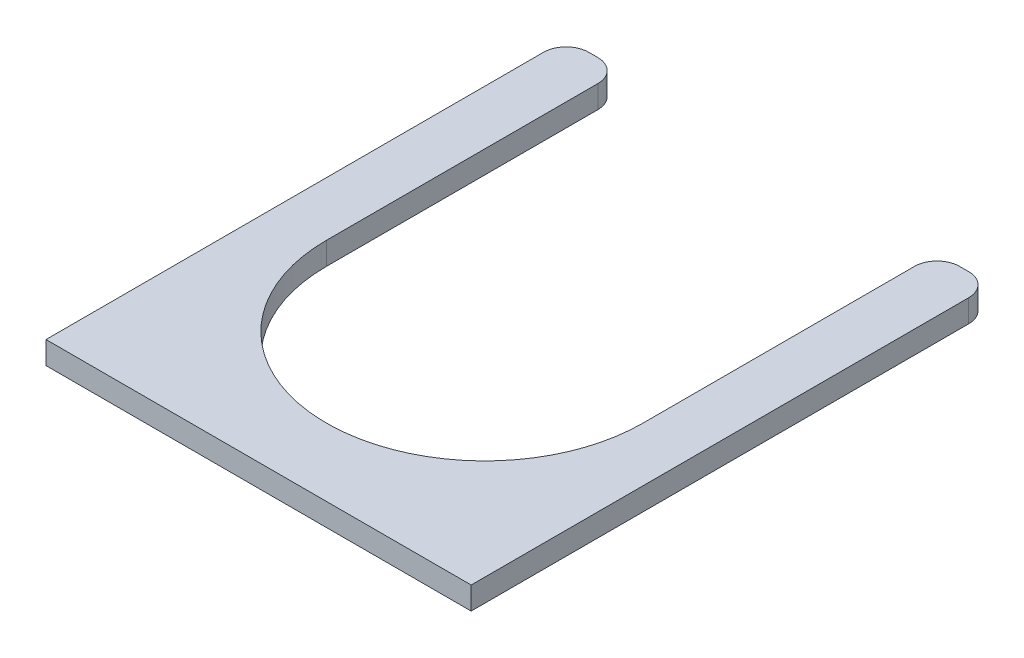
ISO-10303-21;
HEADER;
FILE_DESCRIPTION(('STEP AP214'),'2;1');
FILE_NAME('part.step','',(''),(''),'','','');
FILE_SCHEMA(('AUTOMOTIVE_DESIGN { 1 0 10303 214 1 1 1 1 }'));
ENDSEC;
DATA;
#1=APPLICATION_CONTEXT('core data for automotive mechanical design processes');
#2=APPLICATION_PROTOCOL_DEFINITION('international standard','automotive_design',2000,#1);
#3=PRODUCT_CONTEXT('',#1,'mechanical');
#4=PRODUCT('Part','Part','',(#3));
#5=PRODUCT_RELATED_PRODUCT_CATEGORY('part','',(#4));
#6=PRODUCT_DEFINITION_FORMATION('','',#4);
#7=PRODUCT_DEFINITION_CONTEXT('part definition',#1,'design');
#8=PRODUCT_DEFINITION('design','',#6,#7);
#9=PRODUCT_DEFINITION_SHAPE('','',#8);
#10=(LENGTH_UNIT() NAMED_UNIT(*) SI_UNIT(.MILLI.,.METRE.));
#11=(NAMED_UNIT(*) PLANE_ANGLE_UNIT() SI_UNIT($,.RADIAN.));
#12=(NAMED_UNIT(*) SI_UNIT($,.STERADIAN.) SOLID_ANGLE_UNIT());
#13=UNCERTAINTY_MEASURE_WITH_UNIT(LENGTH_MEASURE(1.E-05),#10,'distance_accuracy_value','');
#14=(GEOMETRIC_REPRESENTATION_CONTEXT(3) GLOBAL_UNCERTAINTY_ASSIGNED_CONTEXT((#13)) GLOBAL_UNIT_ASSIGNED_CONTEXT((#10,
#11,#12)) REPRESENTATION_CONTEXT('',''));
#15=CARTESIAN_POINT('',(0.,0.,0.));
#16=DIRECTION('',(0.,0.,1.));
#17=DIRECTION('',(1.,0.,0.));
#18=AXIS2_PLACEMENT_3D('',#15,#16,#17);
#19=CARTESIAN_POINT('',(47.,-5.,-52.5));
#20=DIRECTION('',(1.,0.,0.));
#21=DIRECTION('',(0.,0.,-1.));
#22=AXIS2_PLACEMENT_3D('',#19,#20,#21);
#23=PLANE('',#22);
#24=DIRECTION('',(0.,0.,-1.));
#25=VECTOR('',#24,1.);
#26=CARTESIAN_POINT('',(47.,0.,-52.5));
#27=LINE('',#26,#25);
#28=CARTESIAN_POINT('',(47.,0.,57.5));
#29=VERTEX_POINT('',#28);
#30=CARTESIAN_POINT('',(47.,0.,-52.5));
#31=VERTEX_POINT('',#30);
#32=EDGE_CURVE('E155',#29,#31,#27,.T.);
#33=ORIENTED_EDGE('',*,*,#32,.F.);
#34=DIRECTION('',(0.,1.,0.));
#35=VECTOR('',#34,1.);
#36=CARTESIAN_POINT('',(47.,-5.,57.5));
#37=LINE('',#36,#35);
#38=CARTESIAN_POINT('',(47.,-5.,57.5));
#39=VERTEX_POINT('',#38);
#40=EDGE_CURVE('E11',#39,#29,#37,.T.);
#41=ORIENTED_EDGE('',*,*,#40,.F.);
#42=DIRECTION('',(0.,0.,-1.));
#43=VECTOR('',#42,1.);
#44=CARTESIAN_POINT('',(47.,-5.,-52.5));
#45=LINE('',#44,#43);
#46=CARTESIAN_POINT('',(47.,-5.,-52.5));
#47=VERTEX_POINT('',#46);
#48=EDGE_CURVE('E187',#39,#47,#45,.T.);
#49=ORIENTED_EDGE('',*,*,#48,.T.);
#50=DIRECTION('',(0.,1.,0.));
#51=VECTOR('',#50,1.);
#52=CARTESIAN_POINT('',(47.,-5.,-52.5));
#53=LINE('',#52,#51);
#54=EDGE_CURVE('E37',#47,#31,#53,.T.);
#55=ORIENTED_EDGE('',*,*,#54,.T.);
#56=EDGE_LOOP('',(#33,#41,#49,#55));
#57=FACE_BOUND('',#56,.T.);
#58=ADVANCED_FACE('F34',(#57),#23,.T.);
#59=CARTESIAN_POINT('',(-47.,-5.,57.5));
#60=DIRECTION('',(0.,0.,1.));
#61=DIRECTION('',(1.,0.,0.));
#62=AXIS2_PLACEMENT_3D('',#59,#60,#61);
#63=PLANE('',#62);
#64=DIRECTION('',(1.,0.,0.));
#65=VECTOR('',#64,1.);
#66=CARTESIAN_POINT('',(-47.,0.,57.5));
#67=LINE('',#66,#65);
#68=CARTESIAN_POINT('',(-47.,0.,57.5));
#69=VERTEX_POINT('',#68);
#70=EDGE_CURVE('E185',#69,#29,#67,.T.);
#71=ORIENTED_EDGE('',*,*,#70,.F.);
#72=DIRECTION('',(0.,1.,0.));
#73=VECTOR('',#72,1.);
#74=CARTESIAN_POINT('',(-47.,-5.,57.5));
#75=LINE('',#74,#73);
#76=CARTESIAN_POINT('',(-47.,-5.,57.5));
#77=VERTEX_POINT('',#76);
#78=EDGE_CURVE('E43',#77,#69,#75,.T.);
#79=ORIENTED_EDGE('',*,*,#78,.F.);
#80=DIRECTION('',(1.,0.,0.));
#81=VECTOR('',#80,1.);
#82=CARTESIAN_POINT('',(-47.,-5.,57.5));
#83=LINE('',#82,#81);
#84=EDGE_CURVE('E145',#77,#39,#83,.T.);
#85=ORIENTED_EDGE('',*,*,#84,.T.);
#86=ORIENTED_EDGE('',*,*,#40,.T.);
#87=EDGE_LOOP('',(#71,#79,#85,#86));
#88=FACE_BOUND('',#87,.T.);
#89=ADVANCED_FACE('F207',(#88),#63,.T.);
#90=CARTESIAN_POINT('',(-47.,-5.,-52.5));
#91=DIRECTION('',(-1.,0.,0.));
#92=DIRECTION('',(0.,0.,1.));
#93=AXIS2_PLACEMENT_3D('',#90,#91,#92);
#94=PLANE('',#93);
#95=DIRECTION('',(0.,0.,1.));
#96=VECTOR('',#95,1.);
#97=CARTESIAN_POINT('',(-47.,0.,-52.5));
#98=LINE('',#97,#96);
#99=CARTESIAN_POINT('',(-47.,0.,-52.5));
#100=VERTEX_POINT('',#99);
#101=EDGE_CURVE('E132',#100,#69,#98,.T.);
#102=ORIENTED_EDGE('',*,*,#101,.F.);
#103=DIRECTION('',(0.,1.,0.));
#104=VECTOR('',#103,1.);
#105=CARTESIAN_POINT('',(-47.,-5.,-52.5));
#106=LINE('',#105,#104);
#107=CARTESIAN_POINT('',(-47.,-5.,-52.5));
#108=VERTEX_POINT('',#107);
#109=EDGE_CURVE('E127',#108,#100,#106,.T.);
#110=ORIENTED_EDGE('',*,*,#109,.F.);
#111=DIRECTION('',(0.,0.,1.));
#112=VECTOR('',#111,1.);
#113=CARTESIAN_POINT('',(-47.,-5.,-52.5));
#114=LINE('',#113,#112);
#115=EDGE_CURVE('E130',#108,#77,#114,.T.);
#116=ORIENTED_EDGE('',*,*,#115,.T.);
#117=ORIENTED_EDGE('',*,*,#78,.T.);
#118=EDGE_LOOP('',(#102,#110,#116,#117));
#119=FACE_BOUND('',#118,.T.);
#120=ADVANCED_FACE('F129',(#119),#94,.T.);
#121=CARTESIAN_POINT('',(-42.,-5.,-52.5));
#122=DIRECTION('',(0.,1.,0.));
#123=DIRECTION('',(0.,0.,1.));
#124=AXIS2_PLACEMENT_3D('',#121,#122,#123);
#125=CYLINDRICAL_SURFACE('',#124,5.);
#126=CARTESIAN_POINT('',(-42.,0.,-52.5));
#127=DIRECTION('',(0.,1.,0.));
#128=DIRECTION('',(0.,0.,1.));
#129=AXIS2_PLACEMENT_3D('',#126,#127,#128);
#130=CIRCLE('',#129,5.);
#131=CARTESIAN_POINT('',(-42.,0.,-57.5));
#132=VERTEX_POINT('',#131);
#133=EDGE_CURVE('E182',#132,#100,#130,.T.);
#134=ORIENTED_EDGE('',*,*,#133,.F.);
#135=DIRECTION('',(0.,1.,0.));
#136=VECTOR('',#135,1.);
#137=CARTESIAN_POINT('',(-42.,-5.,-57.5));
#138=LINE('',#137,#136);
#139=CARTESIAN_POINT('',(-42.,-5.,-57.5));
#140=VERTEX_POINT('',#139);
#141=EDGE_CURVE('E137',#140,#132,#138,.T.);
#142=ORIENTED_EDGE('',*,*,#141,.F.);
#143=CARTESIAN_POINT('',(-42.,-5.,-52.5));
#144=DIRECTION('',(0.,1.,0.));
#145=DIRECTION('',(0.,0.,1.));
#146=AXIS2_PLACEMENT_3D('',#143,#144,#145);
#147=CIRCLE('',#146,5.);
#148=EDGE_CURVE('E143',#140,#108,#147,.T.);
#149=ORIENTED_EDGE('',*,*,#148,.T.);
#150=ORIENTED_EDGE('',*,*,#109,.T.);
#151=EDGE_LOOP('',(#134,#142,#149,#150));
#152=FACE_BOUND('',#151,.T.);
#153=ADVANCED_FACE('F147',(#152),#125,.T.);
#154=CARTESIAN_POINT('',(-42.,-5.,-57.5));
#155=DIRECTION('',(0.,0.,-1.));
#156=DIRECTION('',(-1.,0.,0.));
#157=AXIS2_PLACEMENT_3D('',#154,#155,#156);
#158=PLANE('',#157);
#159=DIRECTION('',(-1.,0.,0.));
#160=VECTOR('',#159,1.);
#161=CARTESIAN_POINT('',(-42.,0.,-57.5));
#162=LINE('',#161,#160);
#163=CARTESIAN_POINT('',(-40.,0.,-57.5));
#164=VERTEX_POINT('',#163);
#165=EDGE_CURVE('E179',#164,#132,#162,.T.);
#166=ORIENTED_EDGE('',*,*,#165,.F.);
#167=DIRECTION('',(0.,1.,0.));
#168=VECTOR('',#167,1.);
#169=CARTESIAN_POINT('',(-40.,-5.,-57.5));
#170=LINE('',#169,#168);
#171=CARTESIAN_POINT('',(-40.,-5.,-57.5));
#172=VERTEX_POINT('',#171);
#173=EDGE_CURVE('E191',#172,#164,#170,.T.);
#174=ORIENTED_EDGE('',*,*,#173,.F.);
#175=DIRECTION('',(-1.,0.,0.));
#176=VECTOR('',#175,1.);
#177=CARTESIAN_POINT('',(-42.,-5.,-57.5));
#178=LINE('',#177,#176);
#179=EDGE_CURVE('E148',#172,#140,#178,.T.);
#180=ORIENTED_EDGE('',*,*,#179,.T.);
#181=ORIENTED_EDGE('',*,*,#141,.T.);
#182=EDGE_LOOP('',(#166,#174,#180,#181));
#183=FACE_BOUND('',#182,.T.);
#184=ADVANCED_FACE('F220',(#183),#158,.T.);
#185=CARTESIAN_POINT('',(-40.,-5.,-52.5));
#186=DIRECTION('',(0.,1.,0.));
#187=DIRECTION('',(0.,0.,1.));
#188=AXIS2_PLACEMENT_3D('',#185,#186,#187);
#189=CYLINDRICAL_SURFACE('',#188,5.);
#190=CARTESIAN_POINT('',(-40.,0.,-52.5));
#191=DIRECTION('',(0.,1.,0.));
#192=DIRECTION('',(0.,0.,-1.));
#193=AXIS2_PLACEMENT_3D('',#190,#191,#192);
#194=CIRCLE('',#193,5.);
#195=CARTESIAN_POINT('',(-35.,0.,-52.5));
#196=VERTEX_POINT('',#195);
#197=EDGE_CURVE('E176',#196,#164,#194,.T.);
#198=ORIENTED_EDGE('',*,*,#197,.F.);
#199=DIRECTION('',(0.,1.,0.));
#200=VECTOR('',#199,1.);
#201=CARTESIAN_POINT('',(-35.,-5.,-52.5));
#202=LINE('',#201,#200);
#203=CARTESIAN_POINT('',(-35.,-5.,-52.5));
#204=VERTEX_POINT('',#203);
#205=EDGE_CURVE('E193',#204,#196,#202,.T.);
#206=ORIENTED_EDGE('',*,*,#205,.F.);
#207=CARTESIAN_POINT('',(-40.,-5.,-52.5));
#208=DIRECTION('',(0.,1.,0.));
#209=DIRECTION('',(0.,0.,-1.));
#210=AXIS2_PLACEMENT_3D('',#207,#208,#209);
#211=CIRCLE('',#210,5.);
#212=EDGE_CURVE('E150',#204,#172,#211,.T.);
#213=ORIENTED_EDGE('',*,*,#212,.T.);
#214=ORIENTED_EDGE('',*,*,#173,.T.);
#215=EDGE_LOOP('',(#198,#206,#213,#214));
#216=FACE_BOUND('',#215,.T.);
#217=ADVANCED_FACE('F223',(#216),#189,.T.);
#218=CARTESIAN_POINT('',(-35.,-5.,-52.5));
#219=DIRECTION('',(1.,0.,0.));
#220=DIRECTION('',(0.,0.,-1.));
#221=AXIS2_PLACEMENT_3D('',#218,#219,#220);
#222=PLANE('',#221);
#223=DIRECTION('',(0.,0.,-1.));
#224=VECTOR('',#223,1.);
#225=CARTESIAN_POINT('',(-35.,0.,-52.5));
#226=LINE('',#225,#224);
#227=CARTESIAN_POINT('',(-35.,0.,7.49999999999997));
#228=VERTEX_POINT('',#227);
#229=EDGE_CURVE('E173',#228,#196,#226,.T.);
#230=ORIENTED_EDGE('',*,*,#229,.F.);
#231=DIRECTION('',(0.,1.,0.));
#232=VECTOR('',#231,1.);
#233=CARTESIAN_POINT('',(-35.,-5.,7.49999999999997));
#234=LINE('',#233,#232);
#235=CARTESIAN_POINT('',(-35.,-5.,7.49999999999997));
#236=VERTEX_POINT('',#235);
#237=EDGE_CURVE('E195',#236,#228,#234,.T.);
#238=ORIENTED_EDGE('',*,*,#237,.F.);
#239=DIRECTION('',(0.,0.,-1.));
#240=VECTOR('',#239,1.);
#241=CARTESIAN_POINT('',(-35.,-5.,-52.5));
#242=LINE('',#241,#240);
#243=EDGE_CURVE('E377',#236,#204,#242,.T.);
#244=ORIENTED_EDGE('',*,*,#243,.T.);
#245=ORIENTED_EDGE('',*,*,#205,.T.);
#246=EDGE_LOOP('',(#230,#238,#244,#245));
#247=FACE_BOUND('',#246,.T.);
#248=ADVANCED_FACE('F227',(#247),#222,.T.);
#249=CARTESIAN_POINT('',(0.,-5.,7.49999999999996));
#250=DIRECTION('',(0.,1.,0.));
#251=DIRECTION('',(0.,0.,1.));
#252=AXIS2_PLACEMENT_3D('',#249,#250,#251);
#253=CYLINDRICAL_SURFACE('',#252,35.);
#254=CARTESIAN_POINT('',(0.,0.,7.49999999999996));
#255=DIRECTION('',(0.,-1.,0.));
#256=DIRECTION('',(0.,0.,1.));
#257=AXIS2_PLACEMENT_3D('',#254,#255,#256);
#258=CIRCLE('',#257,35.);
#259=CARTESIAN_POINT('',(35.,0.,7.50000000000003));
#260=VERTEX_POINT('',#259);
#261=EDGE_CURVE('E170',#260,#228,#258,.T.);
#262=ORIENTED_EDGE('',*,*,#261,.F.);
#263=DIRECTION('',(0.,1.,0.));
#264=VECTOR('',#263,1.);
#265=CARTESIAN_POINT('',(35.,-5.,7.50000000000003));
#266=LINE('',#265,#264);
#267=CARTESIAN_POINT('',(35.,-5.,7.50000000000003));
#268=VERTEX_POINT('',#267);
#269=EDGE_CURVE('E197',#268,#260,#266,.T.);
#270=ORIENTED_EDGE('',*,*,#269,.F.);
#271=CARTESIAN_POINT('',(0.,-5.,7.49999999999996));
#272=DIRECTION('',(0.,-1.,0.));
#273=DIRECTION('',(0.,0.,1.));
#274=AXIS2_PLACEMENT_3D('',#271,#272,#273);
#275=CIRCLE('',#274,35.);
#276=EDGE_CURVE('E381',#268,#236,#275,.T.);
#277=ORIENTED_EDGE('',*,*,#276,.T.);
#278=ORIENTED_EDGE('',*,*,#237,.T.);
#279=EDGE_LOOP('',(#262,#270,#277,#278));
#280=FACE_BOUND('',#279,.T.);
#281=ADVANCED_FACE('F231',(#280),#253,.F.);
#282=CARTESIAN_POINT('',(35.,-5.,-52.5));
#283=DIRECTION('',(-1.,0.,0.));
#284=DIRECTION('',(0.,0.,1.));
#285=AXIS2_PLACEMENT_3D('',#282,#283,#284);
#286=PLANE('',#285);
#287=DIRECTION('',(0.,0.,1.));
#288=VECTOR('',#287,1.);
#289=CARTESIAN_POINT('',(35.,0.,-52.5));
#290=LINE('',#289,#288);
#291=CARTESIAN_POINT('',(35.,0.,-52.5));
#292=VERTEX_POINT('',#291);
#293=EDGE_CURVE('E167',#292,#260,#290,.T.);
#294=ORIENTED_EDGE('',*,*,#293,.F.);
#295=DIRECTION('',(0.,1.,0.));
#296=VECTOR('',#295,1.);
#297=CARTESIAN_POINT('',(35.,-5.,-52.5));
#298=LINE('',#297,#296);
#299=CARTESIAN_POINT('',(35.,-5.,-52.5));
#300=VERTEX_POINT('',#299);
#301=EDGE_CURVE('E199',#300,#292,#298,.T.);
#302=ORIENTED_EDGE('',*,*,#301,.F.);
#303=DIRECTION('',(0.,0.,1.));
#304=VECTOR('',#303,1.);
#305=CARTESIAN_POINT('',(35.,-5.,-52.5));
#306=LINE('',#305,#304);
#307=EDGE_CURVE('E370',#300,#268,#306,.T.);
#308=ORIENTED_EDGE('',*,*,#307,.T.);
#309=ORIENTED_EDGE('',*,*,#269,.T.);
#310=EDGE_LOOP('',(#294,#302,#308,#309));
#311=FACE_BOUND('',#310,.T.);
#312=ADVANCED_FACE('F235',(#311),#286,.T.);
#313=CARTESIAN_POINT('',(40.,-5.,-52.5));
#314=DIRECTION('',(0.,1.,0.));
#315=DIRECTION('',(0.,0.,1.));
#316=AXIS2_PLACEMENT_3D('',#313,#314,#315);
#317=CYLINDRICAL_SURFACE('',#316,5.);
#318=CARTESIAN_POINT('',(40.,0.,-52.5));
#319=DIRECTION('',(0.,1.,0.));
#320=DIRECTION('',(0.,0.,1.));
#321=AXIS2_PLACEMENT_3D('',#318,#319,#320);
#322=CIRCLE('',#321,5.);
#323=CARTESIAN_POINT('',(40.,0.,-57.5));
#324=VERTEX_POINT('',#323);
#325=EDGE_CURVE('E164',#324,#292,#322,.T.);
#326=ORIENTED_EDGE('',*,*,#325,.F.);
#327=DIRECTION('',(0.,1.,0.));
#328=VECTOR('',#327,1.);
#329=CARTESIAN_POINT('',(40.,-5.,-57.5));
#330=LINE('',#329,#328);
#331=CARTESIAN_POINT('',(40.,-5.,-57.5));
#332=VERTEX_POINT('',#331);
#333=EDGE_CURVE('E201',#332,#324,#330,.T.);
#334=ORIENTED_EDGE('',*,*,#333,.F.);
#335=CARTESIAN_POINT('',(40.,-5.,-52.5));
#336=DIRECTION('',(0.,1.,0.));
#337=DIRECTION('',(0.,0.,1.));
#338=AXIS2_PLACEMENT_3D('',#335,#336,#337);
#339=CIRCLE('',#338,5.);
#340=EDGE_CURVE('E366',#332,#300,#339,.T.);
#341=ORIENTED_EDGE('',*,*,#340,.T.);
#342=ORIENTED_EDGE('',*,*,#301,.T.);
#343=EDGE_LOOP('',(#326,#334,#341,#342));
#344=FACE_BOUND('',#343,.T.);
#345=ADVANCED_FACE('F239',(#344),#317,.T.);
#346=CARTESIAN_POINT('',(42.,-5.,-57.5));
#347=DIRECTION('',(0.,0.,-1.));
#348=DIRECTION('',(-1.,0.,0.));
#349=AXIS2_PLACEMENT_3D('',#346,#347,#348);
#350=PLANE('',#349);
#351=DIRECTION('',(-1.,0.,0.));
#352=VECTOR('',#351,1.);
#353=CARTESIAN_POINT('',(42.,0.,-57.5));
#354=LINE('',#353,#352);
#355=CARTESIAN_POINT('',(42.,0.,-57.5));
#356=VERTEX_POINT('',#355);
#357=EDGE_CURVE('E161',#356,#324,#354,.T.);
#358=ORIENTED_EDGE('',*,*,#357,.F.);
#359=DIRECTION('',(0.,1.,0.));
#360=VECTOR('',#359,1.);
#361=CARTESIAN_POINT('',(42.,-5.,-57.5));
#362=LINE('',#361,#360);
#363=CARTESIAN_POINT('',(42.,-5.,-57.5));
#364=VERTEX_POINT('',#363);
#365=EDGE_CURVE('E202',#364,#356,#362,.T.);
#366=ORIENTED_EDGE('',*,*,#365,.F.);
#367=DIRECTION('',(-1.,0.,0.));
#368=VECTOR('',#367,1.);
#369=CARTESIAN_POINT('',(42.,-5.,-57.5));
#370=LINE('',#369,#368);
#371=EDGE_CURVE('E387',#364,#332,#370,.T.);
#372=ORIENTED_EDGE('',*,*,#371,.T.);
#373=ORIENTED_EDGE('',*,*,#333,.T.);
#374=EDGE_LOOP('',(#358,#366,#372,#373));
#375=FACE_BOUND('',#374,.T.);
#376=ADVANCED_FACE('F243',(#375),#350,.T.);
#377=CARTESIAN_POINT('',(42.,-5.,-52.5));
#378=DIRECTION('',(0.,1.,0.));
#379=DIRECTION('',(0.,0.,1.));
#380=AXIS2_PLACEMENT_3D('',#377,#378,#379);
#381=CYLINDRICAL_SURFACE('',#380,5.);
#382=CARTESIAN_POINT('',(42.,0.,-52.5));
#383=DIRECTION('',(0.,1.,0.));
#384=DIRECTION('',(0.,0.,-1.));
#385=AXIS2_PLACEMENT_3D('',#382,#383,#384);
#386=CIRCLE('',#385,5.);
#387=EDGE_CURVE('E158',#31,#356,#386,.T.);
#388=ORIENTED_EDGE('',*,*,#387,.F.);
#389=ORIENTED_EDGE('',*,*,#54,.F.);
#390=CARTESIAN_POINT('',(42.,-5.,-52.5));
#391=DIRECTION('',(0.,1.,0.));
#392=DIRECTION('',(0.,0.,-1.));
#393=AXIS2_PLACEMENT_3D('',#390,#391,#392);
#394=CIRCLE('',#393,5.);
#395=EDGE_CURVE('E389',#47,#364,#394,.T.);
#396=ORIENTED_EDGE('',*,*,#395,.T.);
#397=ORIENTED_EDGE('',*,*,#365,.T.);
#398=EDGE_LOOP('',(#388,#389,#396,#397));
#399=FACE_BOUND('',#398,.T.);
#400=ADVANCED_FACE('F204',(#399),#381,.T.);
#401=CARTESIAN_POINT('',(-42.,-5.,-52.5));
#402=DIRECTION('',(0.,1.,0.));
#403=DIRECTION('',(0.,0.,1.));
#404=AXIS2_PLACEMENT_3D('',#401,#402,#403);
#405=PLANE('',#404);
#406=ORIENTED_EDGE('',*,*,#48,.F.);
#407=ORIENTED_EDGE('',*,*,#84,.F.);
#408=ORIENTED_EDGE('',*,*,#115,.F.);
#409=ORIENTED_EDGE('',*,*,#148,.F.);
#410=ORIENTED_EDGE('',*,*,#179,.F.);
#411=ORIENTED_EDGE('',*,*,#212,.F.);
#412=ORIENTED_EDGE('',*,*,#243,.F.);
#413=ORIENTED_EDGE('',*,*,#276,.F.);
#414=ORIENTED_EDGE('',*,*,#307,.F.);
#415=ORIENTED_EDGE('',*,*,#340,.F.);
#416=ORIENTED_EDGE('',*,*,#371,.F.);
#417=ORIENTED_EDGE('',*,*,#395,.F.);
#418=EDGE_LOOP('',(#406,#407,#408,#409,#410,#411,#412,#413,#414,#415,#416,#417));
#419=FACE_BOUND('',#418,.T.);
#420=ADVANCED_FACE('F141',(#419),#405,.F.);
#421=CARTESIAN_POINT('',(-42.,0.,-52.5));
#422=DIRECTION('',(0.,1.,0.));
#423=DIRECTION('',(0.,0.,1.));
#424=AXIS2_PLACEMENT_3D('',#421,#422,#423);
#425=PLANE('',#424);
#426=ORIENTED_EDGE('',*,*,#32,.T.);
#427=ORIENTED_EDGE('',*,*,#387,.T.);
#428=ORIENTED_EDGE('',*,*,#357,.T.);
#429=ORIENTED_EDGE('',*,*,#325,.T.);
#430=ORIENTED_EDGE('',*,*,#293,.T.);
#431=ORIENTED_EDGE('',*,*,#261,.T.);
#432=ORIENTED_EDGE('',*,*,#229,.T.);
#433=ORIENTED_EDGE('',*,*,#197,.T.);
#434=ORIENTED_EDGE('',*,*,#165,.T.);
#435=ORIENTED_EDGE('',*,*,#133,.T.);
#436=ORIENTED_EDGE('',*,*,#101,.T.);
#437=ORIENTED_EDGE('',*,*,#70,.T.);
#438=EDGE_LOOP('',(#426,#427,#428,#429,#430,#431,#432,#433,#434,#435,#436,#437));
#439=FACE_BOUND('',#438,.T.);
#440=ADVANCED_FACE('F206',(#439),#425,.T.);
#441=CLOSED_SHELL('',(#58,#89,#120,#153,#184,#217,#248,#281,#312,#345,#376,#400,#420,#440));
#442=MANIFOLD_SOLID_BREP('B2',#441);
#443=ADVANCED_BREP_SHAPE_REPRESENTATION('',(#18,#442),#14);
#444=SHAPE_DEFINITION_REPRESENTATION(#9,#443);
ENDSEC;
END-ISO-10303-21;
